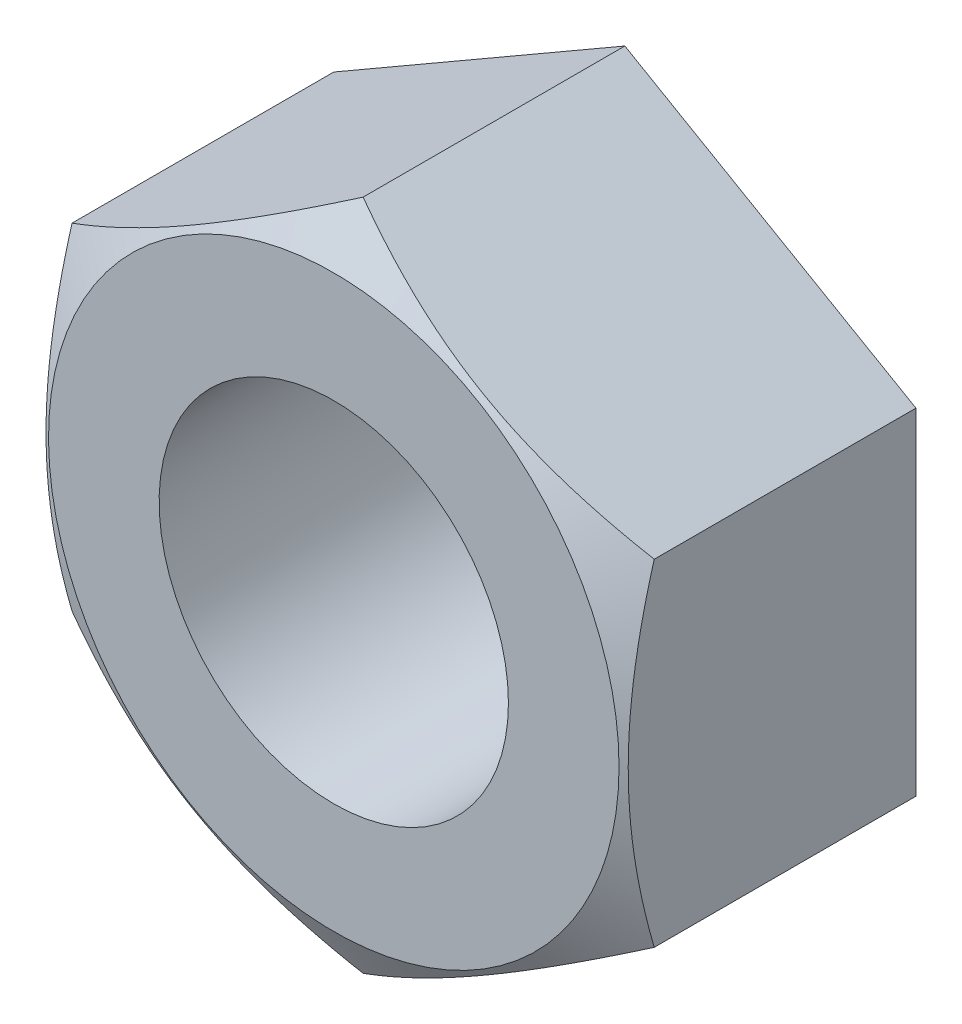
ISO-10303-21;
HEADER;
FILE_DESCRIPTION(('STEP AP214'),'2;1');
FILE_NAME('part.step','',(''),(''),'','','');
FILE_SCHEMA(('AUTOMOTIVE_DESIGN { 1 0 10303 214 1 1 1 1 }'));
ENDSEC;
DATA;
#1=APPLICATION_CONTEXT('core data for automotive mechanical design processes');
#2=APPLICATION_PROTOCOL_DEFINITION('international standard','automotive_design',2000,#1);
#3=PRODUCT_CONTEXT('',#1,'mechanical');
#4=PRODUCT('Part','Part','',(#3));
#5=PRODUCT_RELATED_PRODUCT_CATEGORY('part','',(#4));
#6=PRODUCT_DEFINITION_FORMATION('','',#4);
#7=PRODUCT_DEFINITION_CONTEXT('part definition',#1,'design');
#8=PRODUCT_DEFINITION('design','',#6,#7);
#9=PRODUCT_DEFINITION_SHAPE('','',#8);
#10=(LENGTH_UNIT() NAMED_UNIT(*) SI_UNIT(.MILLI.,.METRE.));
#11=(NAMED_UNIT(*) PLANE_ANGLE_UNIT() SI_UNIT($,.RADIAN.));
#12=(NAMED_UNIT(*) SI_UNIT($,.STERADIAN.) SOLID_ANGLE_UNIT());
#13=UNCERTAINTY_MEASURE_WITH_UNIT(LENGTH_MEASURE(1.E-05),#10,'distance_accuracy_value','');
#14=(GEOMETRIC_REPRESENTATION_CONTEXT(3) GLOBAL_UNCERTAINTY_ASSIGNED_CONTEXT((#13)) GLOBAL_UNIT_ASSIGNED_CONTEXT((#10,
#11,#12)) REPRESENTATION_CONTEXT('',''));
#15=CARTESIAN_POINT('',(0.,0.,0.));
#16=DIRECTION('',(0.,0.,1.));
#17=DIRECTION('',(1.,0.,0.));
#18=AXIS2_PLACEMENT_3D('',#15,#16,#17);
#19=CARTESIAN_POINT('',(-5.,-2.88675134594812,5.));
#20=DIRECTION('',(-1.,0.,0.));
#21=DIRECTION('',(0.,0.,1.));
#22=AXIS2_PLACEMENT_3D('',#19,#20,#21);
#23=PLANE('',#22);
#24=DIRECTION('',(0.,1.,0.));
#25=VECTOR('',#24,1.);
#26=CARTESIAN_POINT('',(-5.,-2.88675134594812,0.));
#27=LINE('',#26,#25);
#28=CARTESIAN_POINT('',(-5.,-2.88675134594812,0.));
#29=VERTEX_POINT('',#28);
#30=CARTESIAN_POINT('',(-5.,2.88675134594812,0.));
#31=VERTEX_POINT('',#30);
#32=EDGE_CURVE('E90',#29,#31,#27,.T.);
#33=ORIENTED_EDGE('',*,*,#32,.F.);
#34=DIRECTION('',(0.,0.,-1.));
#35=VECTOR('',#34,1.);
#36=CARTESIAN_POINT('',(-5.,-2.88675134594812,5.));
#37=LINE('',#36,#35);
#38=CARTESIAN_POINT('',(-5.,-2.88675134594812,4.49568298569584));
#39=VERTEX_POINT('',#38);
#40=EDGE_CURVE('E9',#39,#29,#37,.T.);
#41=ORIENTED_EDGE('',*,*,#40,.F.);
#42=CARTESIAN_POINT('',(-5.,-7.69916314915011,2.52879263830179));
#43=CARTESIAN_POINT('',(-5.,-7.48123566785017,2.63428462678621));
#44=CARTESIAN_POINT('',(-5.,-7.26280196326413,2.7387490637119));
#45=CARTESIAN_POINT('',(-5.,-6.82465268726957,2.94504377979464));
#46=CARTESIAN_POINT('',(-5.,-6.60493691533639,3.04687363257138));
#47=CARTESIAN_POINT('',(-5.,-6.16279540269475,3.24784426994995));
#48=CARTESIAN_POINT('',(-5.,-5.94036138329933,3.34696690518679));
#49=CARTESIAN_POINT('',(-5.,-5.49370479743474,3.54108151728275));
#50=CARTESIAN_POINT('',(-5.,-5.26948231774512,3.63607369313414));
#51=CARTESIAN_POINT('',(-5.,-4.81186990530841,3.82371447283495));
#52=CARTESIAN_POINT('',(-5.,-4.57841191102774,3.91619801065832));
#53=CARTESIAN_POINT('',(-5.,-4.10874431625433,4.09403138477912));
#54=CARTESIAN_POINT('',(-5.,-3.87253440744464,4.17938041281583));
#55=CARTESIAN_POINT('',(-5.,-3.39744748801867,4.34066379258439));
#56=CARTESIAN_POINT('',(-5.,-3.15857718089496,4.41661768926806));
#57=CARTESIAN_POINT('',(-5.,-2.67741088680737,4.55663729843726));
#58=CARTESIAN_POINT('',(-5.,-2.43511602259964,4.62070681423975));
#59=CARTESIAN_POINT('',(-5.,-1.94829753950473,4.73350919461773));
#60=CARTESIAN_POINT('',(-5.,-1.70379306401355,4.78232313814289));
#61=CARTESIAN_POINT('',(-5.,-1.21180206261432,4.8618173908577));
#62=CARTESIAN_POINT('',(-5.,-0.964315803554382,4.89249931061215));
#63=CARTESIAN_POINT('',(-5.,-0.470806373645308,4.93287916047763));
#64=CARTESIAN_POINT('',(-5.,-0.224805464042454,4.94284247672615));
#65=CARTESIAN_POINT('',(-5.,0.267162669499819,4.94163567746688));
#66=CARTESIAN_POINT('',(-5.,0.513129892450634,4.93046503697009));
#67=CARTESIAN_POINT('',(-5.,0.932362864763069,4.89419652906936));
#68=CARTESIAN_POINT('',(-5.,1.10608264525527,4.87406050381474));
#69=CARTESIAN_POINT('',(-5.,1.45220651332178,4.82453023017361));
#70=CARTESIAN_POINT('',(-5.,1.62461041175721,4.79513467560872));
#71=CARTESIAN_POINT('',(-5.,2.13964368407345,4.69460847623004));
#72=CARTESIAN_POINT('',(-5.,2.47989285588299,4.61115802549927));
#73=CARTESIAN_POINT('',(-5.,2.98858270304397,4.46701503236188));
#74=CARTESIAN_POINT('',(-5.,3.15967426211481,4.41514963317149));
#75=CARTESIAN_POINT('',(-5.,3.50019443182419,4.30617266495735));
#76=CARTESIAN_POINT('',(-5.,3.66962303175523,4.24906106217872));
#77=CARTESIAN_POINT('',(-5.,4.00687370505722,4.1304964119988));
#78=CARTESIAN_POINT('',(-5.,4.17469631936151,4.06904488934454));
#79=CARTESIAN_POINT('',(-5.,4.50896068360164,3.94250927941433));
#80=CARTESIAN_POINT('',(-5.,4.6754024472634,3.87742522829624));
#81=CARTESIAN_POINT('',(-5.,5.05778273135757,3.72385967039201));
#82=CARTESIAN_POINT('',(-5.,5.27329135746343,3.6343099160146));
#83=CARTESIAN_POINT('',(-5.,5.70256106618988,3.45110475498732));
#84=CARTESIAN_POINT('',(-5.,5.91632205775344,3.35744913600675));
#85=CARTESIAN_POINT('',(-5.,6.34240549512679,3.1668292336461));
#86=CARTESIAN_POINT('',(-5.,6.55472767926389,3.06986436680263));
#87=CARTESIAN_POINT('',(-5.,6.9781321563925,2.87326056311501));
#88=CARTESIAN_POINT('',(-5.,7.1892144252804,2.77362157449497));
#89=CARTESIAN_POINT('',(-5.,7.82128006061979,2.47126703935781));
#90=CARTESIAN_POINT('',(-5.,8.24070087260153,2.2652867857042));
#91=CARTESIAN_POINT('',(-5.,9.07656071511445,1.84736367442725));
#92=CARTESIAN_POINT('',(-5.,9.49299964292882,1.63542061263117));
#93=CARTESIAN_POINT('',(-5.,10.099433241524,1.32283436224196));
#94=CARTESIAN_POINT('',(-5.,10.2903000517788,1.22387823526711));
#95=CARTESIAN_POINT('',(-5.,10.6716183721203,1.02517701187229));
#96=CARTESIAN_POINT('',(-5.,10.8620698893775,0.925431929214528));
#97=CARTESIAN_POINT('',(-5.,11.4328987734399,0.625162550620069));
#98=CARTESIAN_POINT('',(-5.,11.8127361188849,0.423611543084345));
#99=CARTESIAN_POINT('',(-5.,12.5704213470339,0.0188767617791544));
#100=CARTESIAN_POINT('',(-5.,12.9482717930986,-0.184302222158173));
#101=CARTESIAN_POINT('',(-5.,13.7030537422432,-0.592315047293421));
#102=CARTESIAN_POINT('',(-5.,14.0799852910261,-0.797148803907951));
#103=CARTESIAN_POINT('',(-5.,14.456575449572,-1.00260440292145));
#104=B_SPLINE_CURVE_WITH_KNOTS('',3,(#42,#43,#44,#45,#46,#47,#48,#49,#50,#51,#52,#53,#54,#55,
#56,#57,#58,#59,#60,#61,#62,#63,#64,#65,#66,#67,#68,#69,#70,#71,#72,#73,#74,#75,#76,#77,#78,#79,
#80,#81,#82,#83,#84,#85,#86,#87,#88,#89,#90,#91,#92,#93,#94,#95,#96,#97,#98,#99,#100,#101,#102,
#103),.UNSPECIFIED.,.F.,.F.,(4,2,2,2,2,2,2,2,2,2,2,2,2,2,2,2,2,2,2,2,2,2,2,2,2,2,2,2,2,2,4),(0.,
0.726362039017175,1.45284090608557,2.183368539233,2.91386093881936,3.66709851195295,
4.42042130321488,5.17214959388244,5.92363689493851,6.67105952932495,7.41841576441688,
8.15613856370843,8.89387968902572,9.41827283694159,9.94273999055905,10.9922797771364,
11.5285766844,12.0648770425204,12.600989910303,13.1370974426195,13.8371612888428,
14.5372613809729,15.2374855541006,15.9377232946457,17.339454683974,18.7412341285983,
19.3862148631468,20.0311843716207,21.3211718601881,22.6082083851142,23.8951795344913),.UNSPECIFIED.);
#105=CARTESIAN_POINT('',(-5.,2.88675134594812,4.49568298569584));
#106=VERTEX_POINT('',#105);
#107=EDGE_CURVE('E36',#39,#106,#104,.T.);
#108=ORIENTED_EDGE('',*,*,#107,.T.);
#109=DIRECTION('',(0.,0.,-1.));
#110=VECTOR('',#109,1.);
#111=CARTESIAN_POINT('',(-5.,2.88675134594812,5.));
#112=LINE('',#111,#110);
#113=EDGE_CURVE('E76',#106,#31,#112,.T.);
#114=ORIENTED_EDGE('',*,*,#113,.T.);
#115=EDGE_LOOP('',(#33,#41,#108,#114));
#116=FACE_BOUND('',#115,.T.);
#117=ADVANCED_FACE('F14',(#116),#23,.T.);
#118=CARTESIAN_POINT('',(-5.,-2.88675134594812,5.));
#119=DIRECTION('',(0.5,0.86602540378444,0.));
#120=DIRECTION('',(-0.86602540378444,0.5,0.));
#121=AXIS2_PLACEMENT_3D('',#118,#119,#120);
#122=PLANE('',#121);
#123=DIRECTION('',(-0.866025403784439,0.5,0.));
#124=VECTOR('',#123,1.);
#125=CARTESIAN_POINT('',(0.,-5.77350269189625,0.));
#126=LINE('',#125,#124);
#127=CARTESIAN_POINT('',(0.,-5.77350269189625,0.));
#128=VERTEX_POINT('',#127);
#129=EDGE_CURVE('E97',#128,#29,#126,.T.);
#130=ORIENTED_EDGE('',*,*,#129,.F.);
#131=DIRECTION('',(0.,0.,-1.));
#132=VECTOR('',#131,1.);
#133=CARTESIAN_POINT('',(0.,-5.77350269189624,5.));
#134=LINE('',#133,#132);
#135=CARTESIAN_POINT('',(0.,-5.77350269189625,4.49568298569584));
#136=VERTEX_POINT('',#135);
#137=EDGE_CURVE('E23',#136,#128,#134,.T.);
#138=ORIENTED_EDGE('',*,*,#137,.F.);
#139=CARTESIAN_POINT('',(-5.0002,-2.88663587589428,4.49561631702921));
#140=CARTESIAN_POINT('',(-4.78046540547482,-3.01349970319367,4.56887840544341));
#141=CARTESIAN_POINT('',(-4.55885141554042,-3.14144859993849,4.63551365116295));
#142=CARTESIAN_POINT('',(-4.11178600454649,-3.3995619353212,4.75182598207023));
#143=CARTESIAN_POINT('',(-3.88632664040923,-3.52973095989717,4.80146192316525));
#144=CARTESIAN_POINT('',(-3.43816769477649,-3.78847564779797,4.87871394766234));
#145=CARTESIAN_POINT('',(-3.21553790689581,-3.91701101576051,4.90684459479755));
#146=CARTESIAN_POINT('',(-2.88081009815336,-4.11026620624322,4.93207005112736));
#147=CARTESIAN_POINT('',(-2.76915780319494,-4.1747286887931,4.93765151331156));
#148=CARTESIAN_POINT('',(-2.5457500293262,-4.30371322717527,4.94306275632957));
#149=CARTESIAN_POINT('',(-2.43399455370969,-4.36823528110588,4.94289271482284));
#150=CARTESIAN_POINT('',(-2.12781576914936,-4.54500768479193,4.93451134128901));
#151=CARTESIAN_POINT('',(-1.93349391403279,-4.65719946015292,4.92043520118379));
#152=CARTESIAN_POINT('',(-1.5461398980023,-4.8808384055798,4.87579971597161));
#153=CARTESIAN_POINT('',(-1.35310909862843,-4.99228478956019,4.84522511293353));
#154=CARTESIAN_POINT('',(-0.964974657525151,-5.21637431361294,4.76879647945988));
#155=CARTESIAN_POINT('',(-0.769920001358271,-5.32898917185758,4.72261859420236));
#156=CARTESIAN_POINT('',(-0.382719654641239,-5.55253939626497,4.61781317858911));
#157=CARTESIAN_POINT('',(-0.190569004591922,-5.6634776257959,4.55921026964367));
#158=CARTESIAN_POINT('',(0.000199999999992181,-5.77361816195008,4.49561631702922));
#159=B_SPLINE_CURVE_WITH_KNOTS('',3,(#139,#140,#141,#142,#143,#144,#145,#146,#147,#148,#149,
#150,#151,#152,#153,#154,#155,#156,#157,#158),.UNSPECIFIED.,.F.,.F.,(4,2,2,2,2,2,2,2,2,4),(0.,
0.79255584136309,1.58701660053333,2.3618153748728,2.74884076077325,3.13585419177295,
3.80962362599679,4.48401723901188,5.17336882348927,5.86136694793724),.UNSPECIFIED.);
#160=EDGE_CURVE('E144',#39,#136,#159,.T.);
#161=ORIENTED_EDGE('',*,*,#160,.F.);
#162=ORIENTED_EDGE('',*,*,#40,.T.);
#163=EDGE_LOOP('',(#130,#138,#161,#162));
#164=FACE_BOUND('',#163,.T.);
#165=ADVANCED_FACE('F16',(#164),#122,.F.);
#166=CARTESIAN_POINT('',(5.,-2.88675134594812,5.));
#167=DIRECTION('',(0.5,-0.86602540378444,0.));
#168=DIRECTION('',(0.86602540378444,0.5,0.));
#169=AXIS2_PLACEMENT_3D('',#166,#167,#168);
#170=PLANE('',#169);
#171=DIRECTION('',(-0.866025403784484,-0.499999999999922,0.));
#172=VECTOR('',#171,1.);
#173=CARTESIAN_POINT('',(5.,-2.88675134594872,0.));
#174=LINE('',#173,#172);
#175=CARTESIAN_POINT('',(5.,-2.88675134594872,0.));
#176=VERTEX_POINT('',#175);
#177=EDGE_CURVE('E94',#176,#128,#174,.T.);
#178=ORIENTED_EDGE('',*,*,#177,.F.);
#179=DIRECTION('',(0.,0.,-1.));
#180=VECTOR('',#179,1.);
#181=CARTESIAN_POINT('',(5.,-2.88675134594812,5.));
#182=LINE('',#181,#180);
#183=CARTESIAN_POINT('',(5.,-2.88675134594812,4.49568298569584));
#184=VERTEX_POINT('',#183);
#185=EDGE_CURVE('E178',#184,#176,#182,.T.);
#186=ORIENTED_EDGE('',*,*,#185,.F.);
#187=CARTESIAN_POINT('',(5.0002,-2.88663587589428,4.49561631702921));
#188=CARTESIAN_POINT('',(4.78046540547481,-3.01349970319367,4.56887840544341));
#189=CARTESIAN_POINT('',(4.55885141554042,-3.14144859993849,4.63551365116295));
#190=CARTESIAN_POINT('',(4.11178600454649,-3.3995619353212,4.75182598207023));
#191=CARTESIAN_POINT('',(3.88632664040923,-3.52973095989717,4.80146192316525));
#192=CARTESIAN_POINT('',(3.43816769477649,-3.78847564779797,4.87871394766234));
#193=CARTESIAN_POINT('',(3.21553790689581,-3.91701101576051,4.90684459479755));
#194=CARTESIAN_POINT('',(2.88081009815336,-4.11026620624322,4.93207005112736));
#195=CARTESIAN_POINT('',(2.76915780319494,-4.1747286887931,4.93765151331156));
#196=CARTESIAN_POINT('',(2.5457500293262,-4.30371322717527,4.94306275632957));
#197=CARTESIAN_POINT('',(2.43399455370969,-4.36823528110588,4.94289271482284));
#198=CARTESIAN_POINT('',(2.12781576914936,-4.54500768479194,4.93451134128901));
#199=CARTESIAN_POINT('',(1.93349391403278,-4.65719946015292,4.92043520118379));
#200=CARTESIAN_POINT('',(1.54613989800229,-4.88083840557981,4.87579971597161));
#201=CARTESIAN_POINT('',(1.35310909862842,-4.9922847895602,4.84522511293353));
#202=CARTESIAN_POINT('',(0.964974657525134,-5.21637431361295,4.76879647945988));
#203=CARTESIAN_POINT('',(0.769920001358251,-5.32898917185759,4.72261859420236));
#204=CARTESIAN_POINT('',(0.382719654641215,-5.55253939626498,4.6178131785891));
#205=CARTESIAN_POINT('',(0.190569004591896,-5.66347762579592,4.55921026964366));
#206=CARTESIAN_POINT('',(-0.000200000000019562,-5.7736181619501,4.49561631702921));
#207=B_SPLINE_CURVE_WITH_KNOTS('',3,(#187,#188,#189,#190,#191,#192,#193,#194,#195,#196,#197,
#198,#199,#200,#201,#202,#203,#204,#205,#206),.UNSPECIFIED.,.F.,.F.,(4,2,2,2,2,2,2,2,2,4),(0.,
0.79255584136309,1.58701660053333,2.3618153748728,2.74884076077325,3.13585419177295,
3.80962362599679,4.4840172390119,5.1733688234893,5.86136694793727),.UNSPECIFIED.);
#208=EDGE_CURVE('E138',#184,#136,#207,.T.);
#209=ORIENTED_EDGE('',*,*,#208,.T.);
#210=ORIENTED_EDGE('',*,*,#137,.T.);
#211=EDGE_LOOP('',(#178,#186,#209,#210));
#212=FACE_BOUND('',#211,.T.);
#213=ADVANCED_FACE('F184',(#212),#170,.T.);
#214=CARTESIAN_POINT('',(5.,-2.88675134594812,5.));
#215=DIRECTION('',(-1.,0.,0.));
#216=DIRECTION('',(0.,0.,1.));
#217=AXIS2_PLACEMENT_3D('',#214,#215,#216);
#218=PLANE('',#217);
#219=DIRECTION('',(0.,-1.,0.));
#220=VECTOR('',#219,1.);
#221=CARTESIAN_POINT('',(5.,2.88675134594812,0.));
#222=LINE('',#221,#220);
#223=CARTESIAN_POINT('',(5.,2.88675134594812,0.));
#224=VERTEX_POINT('',#223);
#225=EDGE_CURVE('E85',#224,#176,#222,.T.);
#226=ORIENTED_EDGE('',*,*,#225,.F.);
#227=DIRECTION('',(0.,0.,-1.));
#228=VECTOR('',#227,1.);
#229=CARTESIAN_POINT('',(5.,2.88675134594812,5.));
#230=LINE('',#229,#228);
#231=CARTESIAN_POINT('',(5.,2.88675134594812,4.49568298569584));
#232=VERTEX_POINT('',#231);
#233=EDGE_CURVE('E75',#232,#224,#230,.T.);
#234=ORIENTED_EDGE('',*,*,#233,.F.);
#235=CARTESIAN_POINT('',(5.,-7.69916314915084,2.52879263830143));
#236=CARTESIAN_POINT('',(5.,-7.48123566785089,2.63428462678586));
#237=CARTESIAN_POINT('',(5.,-7.26280196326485,2.73874906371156));
#238=CARTESIAN_POINT('',(5.,-6.82465268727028,2.94504377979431));
#239=CARTESIAN_POINT('',(5.,-6.6049369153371,3.04687363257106));
#240=CARTESIAN_POINT('',(5.,-6.16279540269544,3.24784426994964));
#241=CARTESIAN_POINT('',(5.,-5.94036138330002,3.34696690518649));
#242=CARTESIAN_POINT('',(5.,-5.49370479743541,3.54108151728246));
#243=CARTESIAN_POINT('',(5.,-5.26948231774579,3.63607369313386));
#244=CARTESIAN_POINT('',(5.,-4.81186990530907,3.82371447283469));
#245=CARTESIAN_POINT('',(5.,-4.57841191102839,3.91619801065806));
#246=CARTESIAN_POINT('',(5.,-4.10874431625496,4.09403138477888));
#247=CARTESIAN_POINT('',(5.,-3.87253440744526,4.1793804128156));
#248=CARTESIAN_POINT('',(5.,-3.39744748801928,4.34066379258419));
#249=CARTESIAN_POINT('',(5.,-3.15857718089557,4.41661768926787));
#250=CARTESIAN_POINT('',(5.,-2.67741088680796,4.5566372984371));
#251=CARTESIAN_POINT('',(5.,-2.43511602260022,4.6207068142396));
#252=CARTESIAN_POINT('',(5.,-1.9482975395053,4.73350919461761));
#253=CARTESIAN_POINT('',(5.,-1.70379306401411,4.78232313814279));
#254=CARTESIAN_POINT('',(5.,-1.21180206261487,4.86181739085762));
#255=CARTESIAN_POINT('',(5.,-0.964315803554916,4.89249931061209));
#256=CARTESIAN_POINT('',(5.,-0.470806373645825,4.9328791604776));
#257=CARTESIAN_POINT('',(5.,-0.224805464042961,4.94284247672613));
#258=CARTESIAN_POINT('',(5.,0.267162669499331,4.94163567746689));
#259=CARTESIAN_POINT('',(5.,0.513129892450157,4.93046503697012));
#260=CARTESIAN_POINT('',(5.,0.932362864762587,4.89419652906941));
#261=CARTESIAN_POINT('',(5.,1.10608264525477,4.8740605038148));
#262=CARTESIAN_POINT('',(5.,1.45220651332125,4.8245302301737));
#263=CARTESIAN_POINT('',(5.,1.62461041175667,4.79513467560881));
#264=CARTESIAN_POINT('',(5.,2.13964368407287,4.69460847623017));
#265=CARTESIAN_POINT('',(5.,2.47989285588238,4.61115802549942));
#266=CARTESIAN_POINT('',(5.,2.98858270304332,4.46701503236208));
#267=CARTESIAN_POINT('',(5.,3.15967426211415,4.4151496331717));
#268=CARTESIAN_POINT('',(5.,3.5001944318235,4.30617266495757));
#269=CARTESIAN_POINT('',(5.,3.66962303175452,4.24906106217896));
#270=CARTESIAN_POINT('',(5.,4.00687370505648,4.13049641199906));
#271=CARTESIAN_POINT('',(5.,4.17469631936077,4.06904488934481));
#272=CARTESIAN_POINT('',(5.,4.50896068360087,3.94250927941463));
#273=CARTESIAN_POINT('',(5.,4.67540244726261,3.87742522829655));
#274=CARTESIAN_POINT('',(5.,5.0577827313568,3.72385967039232));
#275=CARTESIAN_POINT('',(5.,5.27329135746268,3.63430991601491));
#276=CARTESIAN_POINT('',(5.,5.70256106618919,3.45110475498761));
#277=CARTESIAN_POINT('',(5.,5.91632205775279,3.35744913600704));
#278=CARTESIAN_POINT('',(5.,6.3424054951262,3.16682923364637));
#279=CARTESIAN_POINT('',(5.,6.55472767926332,3.06986436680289));
#280=CARTESIAN_POINT('',(5.,6.97813215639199,2.87326056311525));
#281=CARTESIAN_POINT('',(5.,7.18921442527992,2.7736215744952));
#282=CARTESIAN_POINT('',(5.,7.82128006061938,2.47126703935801));
#283=CARTESIAN_POINT('',(5.,8.24070087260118,2.26528678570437));
#284=CARTESIAN_POINT('',(5.,9.07656071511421,1.84736367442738));
#285=CARTESIAN_POINT('',(5.,9.49299964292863,1.63542061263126));
#286=CARTESIAN_POINT('',(5.,10.0994332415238,1.32283436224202));
#287=CARTESIAN_POINT('',(5.,10.2903000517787,1.22387823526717));
#288=CARTESIAN_POINT('',(5.,10.6716183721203,1.02517701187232));
#289=CARTESIAN_POINT('',(5.,10.8620698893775,0.925431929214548));
#290=CARTESIAN_POINT('',(5.,11.4328987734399,0.625162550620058));
#291=CARTESIAN_POINT('',(5.,11.8127361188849,0.423611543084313));
#292=CARTESIAN_POINT('',(5.,12.5704213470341,0.0188767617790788));
#293=CARTESIAN_POINT('',(5.,12.9482717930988,-0.184302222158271));
#294=CARTESIAN_POINT('',(5.,13.7030537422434,-0.592315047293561));
#295=CARTESIAN_POINT('',(5.,14.0799852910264,-0.79714880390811));
#296=CARTESIAN_POINT('',(5.,14.4565754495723,-1.00260440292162));
#297=B_SPLINE_CURVE_WITH_KNOTS('',3,(#235,#236,#237,#238,#239,#240,#241,#242,#243,#244,#245,
#246,#247,#248,#249,#250,#251,#252,#253,#254,#255,#256,#257,#258,#259,#260,#261,#262,#263,#264,
#265,#266,#267,#268,#269,#270,#271,#272,#273,#274,#275,#276,#277,#278,#279,#280,#281,#282,#283,
#284,#285,#286,#287,#288,#289,#290,#291,#292,#293,#294,#295,#296),.UNSPECIFIED.,.F.,.F.,(4,2,2,
2,2,2,2,2,2,2,2,2,2,2,2,2,2,2,2,2,2,2,2,2,2,2,2,2,2,2,4),(0.,0.726362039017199,1.45284090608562,
2.18336853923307,2.91386093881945,3.66709851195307,4.42042130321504,5.17214959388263,
5.92363689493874,6.67105952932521,7.41841576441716,8.15613856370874,8.89387968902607,
9.41827283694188,9.94273999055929,10.9922797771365,11.5285766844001,12.0648770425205,
12.600989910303,13.1370974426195,13.8371612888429,14.5372613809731,15.2374855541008,
15.937723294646,17.3394546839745,18.741234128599,19.3862148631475,20.0311843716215,
21.321171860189,22.6082083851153,23.8951795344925),.UNSPECIFIED.);
#298=EDGE_CURVE('E131',#184,#232,#297,.T.);
#299=ORIENTED_EDGE('',*,*,#298,.F.);
#300=ORIENTED_EDGE('',*,*,#185,.T.);
#301=EDGE_LOOP('',(#226,#234,#299,#300));
#302=FACE_BOUND('',#301,.T.);
#303=ADVANCED_FACE('F189',(#302),#218,.F.);
#304=CARTESIAN_POINT('',(5.,2.88675134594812,5.));
#305=DIRECTION('',(-0.5,-0.86602540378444,0.));
#306=DIRECTION('',(0.86602540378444,-0.5,0.));
#307=AXIS2_PLACEMENT_3D('',#304,#305,#306);
#308=PLANE('',#307);
#309=DIRECTION('',(0.866025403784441,-0.5,0.));
#310=VECTOR('',#309,1.);
#311=CARTESIAN_POINT('',(0.,5.77350269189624,0.));
#312=LINE('',#311,#310);
#313=CARTESIAN_POINT('',(0.,5.77350269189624,0.));
#314=VERTEX_POINT('',#313);
#315=EDGE_CURVE('E79',#314,#224,#312,.T.);
#316=ORIENTED_EDGE('',*,*,#315,.F.);
#317=DIRECTION('',(0.,0.,-1.));
#318=VECTOR('',#317,1.);
#319=CARTESIAN_POINT('',(0.,5.77350269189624,5.));
#320=LINE('',#319,#318);
#321=CARTESIAN_POINT('',(0.,5.77350269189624,4.49568298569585));
#322=VERTEX_POINT('',#321);
#323=EDGE_CURVE('E66',#322,#314,#320,.T.);
#324=ORIENTED_EDGE('',*,*,#323,.F.);
#325=CARTESIAN_POINT('',(5.0002,2.88663587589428,4.49561631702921));
#326=CARTESIAN_POINT('',(4.78046540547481,3.01349970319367,4.56887840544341));
#327=CARTESIAN_POINT('',(4.55885141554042,3.14144859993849,4.63551365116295));
#328=CARTESIAN_POINT('',(4.11178600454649,3.3995619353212,4.75182598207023));
#329=CARTESIAN_POINT('',(3.88632664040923,3.52973095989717,4.80146192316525));
#330=CARTESIAN_POINT('',(3.43816769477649,3.78847564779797,4.87871394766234));
#331=CARTESIAN_POINT('',(3.21553790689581,3.91701101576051,4.90684459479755));
#332=CARTESIAN_POINT('',(2.88081009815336,4.11026620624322,4.93207005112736));
#333=CARTESIAN_POINT('',(2.76915780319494,4.1747286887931,4.93765151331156));
#334=CARTESIAN_POINT('',(2.5457500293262,4.30371322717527,4.94306275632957));
#335=CARTESIAN_POINT('',(2.43399455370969,4.36823528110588,4.94289271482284));
#336=CARTESIAN_POINT('',(2.12781576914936,4.54500768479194,4.93451134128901));
#337=CARTESIAN_POINT('',(1.93349391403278,4.65719946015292,4.92043520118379));
#338=CARTESIAN_POINT('',(1.54613989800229,4.88083840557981,4.87579971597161));
#339=CARTESIAN_POINT('',(1.35310909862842,4.9922847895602,4.84522511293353));
#340=CARTESIAN_POINT('',(0.964974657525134,5.21637431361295,4.76879647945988));
#341=CARTESIAN_POINT('',(0.769920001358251,5.32898917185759,4.72261859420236));
#342=CARTESIAN_POINT('',(0.382719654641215,5.55253939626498,4.6178131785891));
#343=CARTESIAN_POINT('',(0.190569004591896,5.66347762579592,4.55921026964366));
#344=CARTESIAN_POINT('',(-0.000200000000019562,5.7736181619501,4.49561631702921));
#345=B_SPLINE_CURVE_WITH_KNOTS('',3,(#325,#326,#327,#328,#329,#330,#331,#332,#333,#334,#335,
#336,#337,#338,#339,#340,#341,#342,#343,#344),.UNSPECIFIED.,.F.,.F.,(4,2,2,2,2,2,2,2,2,4),(0.,
0.79255584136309,1.58701660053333,2.3618153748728,2.74884076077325,3.13585419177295,
3.80962362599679,4.4840172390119,5.1733688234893,5.86136694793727),.UNSPECIFIED.);
#346=EDGE_CURVE('E30',#232,#322,#345,.T.);
#347=ORIENTED_EDGE('',*,*,#346,.F.);
#348=ORIENTED_EDGE('',*,*,#233,.T.);
#349=EDGE_LOOP('',(#316,#324,#347,#348));
#350=FACE_BOUND('',#349,.T.);
#351=ADVANCED_FACE('F80',(#350),#308,.F.);
#352=CARTESIAN_POINT('',(-5.,2.88675134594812,5.));
#353=DIRECTION('',(-0.5,0.86602540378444,0.));
#354=DIRECTION('',(-0.86602540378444,-0.5,0.));
#355=AXIS2_PLACEMENT_3D('',#352,#353,#354);
#356=PLANE('',#355);
#357=DIRECTION('',(0.866025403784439,0.5,0.));
#358=VECTOR('',#357,1.);
#359=CARTESIAN_POINT('',(-5.,2.88675134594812,0.));
#360=LINE('',#359,#358);
#361=EDGE_CURVE('E71',#31,#314,#360,.T.);
#362=ORIENTED_EDGE('',*,*,#361,.F.);
#363=ORIENTED_EDGE('',*,*,#113,.F.);
#364=CARTESIAN_POINT('',(-5.0002,2.88663587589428,4.49561631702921));
#365=CARTESIAN_POINT('',(-4.78046540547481,3.01349970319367,4.56887840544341));
#366=CARTESIAN_POINT('',(-4.55885141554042,3.14144859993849,4.63551365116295));
#367=CARTESIAN_POINT('',(-4.11178600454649,3.3995619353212,4.75182598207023));
#368=CARTESIAN_POINT('',(-3.88632664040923,3.52973095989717,4.80146192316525));
#369=CARTESIAN_POINT('',(-3.43816769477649,3.78847564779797,4.87871394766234));
#370=CARTESIAN_POINT('',(-3.21553790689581,3.91701101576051,4.90684459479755));
#371=CARTESIAN_POINT('',(-2.88081009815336,4.11026620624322,4.93207005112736));
#372=CARTESIAN_POINT('',(-2.76915780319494,4.1747286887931,4.93765151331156));
#373=CARTESIAN_POINT('',(-2.5457500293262,4.30371322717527,4.94306275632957));
#374=CARTESIAN_POINT('',(-2.43399455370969,4.36823528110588,4.94289271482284));
#375=CARTESIAN_POINT('',(-2.12781576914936,4.54500768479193,4.93451134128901));
#376=CARTESIAN_POINT('',(-1.93349391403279,4.65719946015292,4.92043520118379));
#377=CARTESIAN_POINT('',(-1.5461398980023,4.8808384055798,4.87579971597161));
#378=CARTESIAN_POINT('',(-1.35310909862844,4.99228478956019,4.84522511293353));
#379=CARTESIAN_POINT('',(-0.964974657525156,5.21637431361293,4.76879647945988));
#380=CARTESIAN_POINT('',(-0.769920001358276,5.32898917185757,4.72261859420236));
#381=CARTESIAN_POINT('',(-0.382719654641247,5.55253939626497,4.61781317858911));
#382=CARTESIAN_POINT('',(-0.19056900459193,5.6634776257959,4.55921026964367));
#383=CARTESIAN_POINT('',(0.000199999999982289,5.77361816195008,4.49561631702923));
#384=B_SPLINE_CURVE_WITH_KNOTS('',3,(#364,#365,#366,#367,#368,#369,#370,#371,#372,#373,#374,
#375,#376,#377,#378,#379,#380,#381,#382,#383),.UNSPECIFIED.,.F.,.F.,(4,2,2,2,2,2,2,2,2,4),(0.,
0.79255584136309,1.58701660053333,2.3618153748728,2.74884076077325,3.13585419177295,
3.80962362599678,4.48401723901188,5.17336882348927,5.86136694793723),.UNSPECIFIED.);
#385=EDGE_CURVE('E73',#106,#322,#384,.T.);
#386=ORIENTED_EDGE('',*,*,#385,.T.);
#387=ORIENTED_EDGE('',*,*,#323,.T.);
#388=EDGE_LOOP('',(#362,#363,#386,#387));
#389=FACE_BOUND('',#388,.T.);
#390=ADVANCED_FACE('F68',(#389),#356,.T.);
#391=CARTESIAN_POINT('',(-5.,2.88675134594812,5.));
#392=DIRECTION('',(0.,0.,1.));
#393=DIRECTION('',(1.,0.,0.));
#394=AXIS2_PLACEMENT_3D('',#391,#392,#393);
#395=PLANE('',#394);
#396=CARTESIAN_POINT('',(0.,0.,5.));
#397=DIRECTION('',(0.,0.,1.));
#398=DIRECTION('',(1.,0.,0.));
#399=AXIS2_PLACEMENT_3D('',#396,#397,#398);
#400=CIRCLE('',#399,3.);
#401=CARTESIAN_POINT('',(3.,0.,5.));
#402=VERTEX_POINT('',#401);
#403=EDGE_CURVE('E154',#402,#402,#400,.T.);
#404=ORIENTED_EDGE('',*,*,#403,.F.);
#405=EDGE_LOOP('',(#404));
#406=FACE_BOUND('',#405,.T.);
#407=CARTESIAN_POINT('',(0.,0.,5.));
#408=DIRECTION('',(0.,0.,1.));
#409=DIRECTION('',(1.,0.,0.));
#410=AXIS2_PLACEMENT_3D('',#407,#408,#409);
#411=CIRCLE('',#410,4.9);
#412=CARTESIAN_POINT('',(4.9,0.,5.));
#413=VERTEX_POINT('',#412);
#414=EDGE_CURVE('E100',#413,#413,#411,.T.);
#415=ORIENTED_EDGE('',*,*,#414,.T.);
#416=EDGE_LOOP('',(#415));
#417=FACE_BOUND('',#416,.T.);
#418=ADVANCED_FACE('F123',(#406,#417),#395,.T.);
#419=CARTESIAN_POINT('',(-5.,8.66025403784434,0.));
#420=DIRECTION('',(0.,0.,1.));
#421=DIRECTION('',(0.,1.,0.));
#422=AXIS2_PLACEMENT_3D('',#419,#420,#421);
#423=PLANE('',#422);
#424=CARTESIAN_POINT('',(0.,0.,0.));
#425=DIRECTION('',(0.,0.,-1.));
#426=DIRECTION('',(0.,-1.,0.));
#427=AXIS2_PLACEMENT_3D('',#424,#425,#426);
#428=CIRCLE('',#427,3.);
#429=CARTESIAN_POINT('',(0.,-3.,0.));
#430=VERTEX_POINT('',#429);
#431=EDGE_CURVE('E171',#430,#430,#428,.T.);
#432=ORIENTED_EDGE('',*,*,#431,.F.);
#433=EDGE_LOOP('',(#432));
#434=FACE_BOUND('',#433,.T.);
#435=ORIENTED_EDGE('',*,*,#361,.T.);
#436=ORIENTED_EDGE('',*,*,#315,.T.);
#437=ORIENTED_EDGE('',*,*,#225,.T.);
#438=ORIENTED_EDGE('',*,*,#177,.T.);
#439=ORIENTED_EDGE('',*,*,#129,.T.);
#440=ORIENTED_EDGE('',*,*,#32,.T.);
#441=EDGE_LOOP('',(#435,#436,#437,#438,#439,#440));
#442=FACE_BOUND('',#441,.T.);
#443=ADVANCED_FACE('F87',(#434,#442),#423,.F.);
#444=CARTESIAN_POINT('',(0.,0.,5.));
#445=DIRECTION('',(0.,0.,-1.));
#446=DIRECTION('',(0.,-1.,0.));
#447=AXIS2_PLACEMENT_3D('',#444,#445,#446);
#448=CYLINDRICAL_SURFACE('',#447,3.);
#449=ORIENTED_EDGE('',*,*,#431,.T.);
#450=EDGE_LOOP('',(#449));
#451=FACE_BOUND('',#450,.T.);
#452=ORIENTED_EDGE('',*,*,#403,.T.);
#453=EDGE_LOOP('',(#452));
#454=FACE_BOUND('',#453,.T.);
#455=ADVANCED_FACE('F122',(#451,#454),#448,.F.);
#456=CARTESIAN_POINT('',(0.,0.,5.));
#457=DIRECTION('',(0.,0.,-1.));
#458=DIRECTION('',(-1.,0.,0.));
#459=AXIS2_PLACEMENT_3D('',#456,#457,#458);
#460=CONICAL_SURFACE('',#459,4.9,1.0471975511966);
#461=ORIENTED_EDGE('',*,*,#160,.T.);
#462=ORIENTED_EDGE('',*,*,#208,.F.);
#463=ORIENTED_EDGE('',*,*,#298,.T.);
#464=ORIENTED_EDGE('',*,*,#346,.T.);
#465=ORIENTED_EDGE('',*,*,#385,.F.);
#466=ORIENTED_EDGE('',*,*,#107,.F.);
#467=EDGE_LOOP('',(#461,#462,#463,#464,#465,#466));
#468=FACE_BOUND('',#467,.T.);
#469=ORIENTED_EDGE('',*,*,#414,.F.);
#470=EDGE_LOOP('',(#469));
#471=FACE_BOUND('',#470,.T.);
#472=ADVANCED_FACE('F118',(#468,#471),#460,.T.);
#473=CLOSED_SHELL('',(#117,#165,#213,#303,#351,#390,#418,#443,#455,#472));
#474=MANIFOLD_SOLID_BREP('B1',#473);
#475=ADVANCED_BREP_SHAPE_REPRESENTATION('',(#18,#474),#14);
#476=SHAPE_DEFINITION_REPRESENTATION(#9,#475);
ENDSEC;
END-ISO-10303-21;
